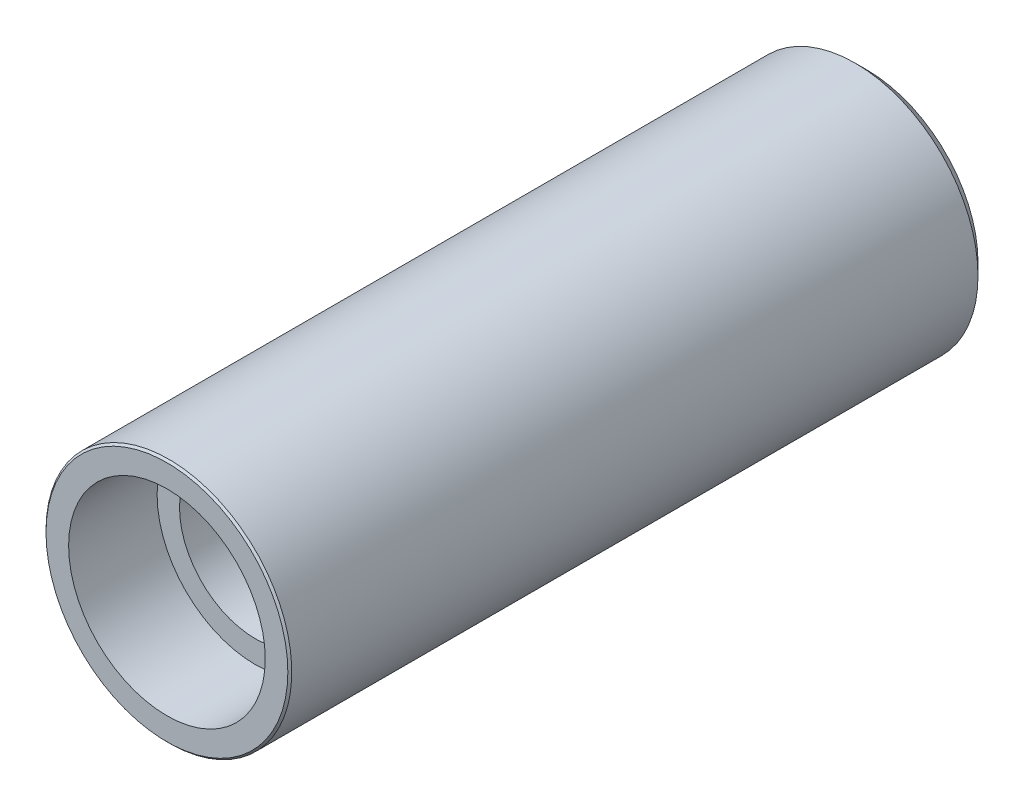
from build123d import *

# Parameters (mm, degrees)
SKETCH1_R      = 7.9375
SKETCH1_R_2    = 4.9022
EXTRUDE1_DEPTH = 45.212
SKETCH3_R      = 6.35
EXTRUDE3_DEPTH = 5.715
CHAMFER1_SIZE  = 0.762
CHAMFER2_SIZE  = 0.127


with BuildPart() as part:
    # Sketch1 → Extrude1 (new body)
    with BuildSketch(Plane.XY):
        with Locations(Location((0, 0, 0), (0, 0, 180))):
            Circle(SKETCH1_R)
        with Locations(Location((0, 0, 0), (0, 0, 180))):
            Circle(SKETCH1_R_2, mode=Mode.SUBTRACT)
    extrude(amount=EXTRUDE1_DEPTH)

    # Sketch3 → Extrude3 (cut)
    with BuildSketch(Plane.XY.offset(45.212)):
        Circle(SKETCH3_R)
    extrude(amount=-EXTRUDE3_DEPTH, mode=Mode.SUBTRACT)

    # Chamfer1
    chamfer1_edges = [part.edges().sort_by_distance(p)[0] for p in [
        (7.9375, 0, 0),
    ]]
    chamfer(chamfer1_edges, length=CHAMFER1_SIZE)

    # Chamfer2
    chamfer2_edges = [part.edges().sort_by_distance(p)[0] for p in [
        (7.9375, 0, 45.212),
    ]]
    chamfer(chamfer2_edges, length=CHAMFER2_SIZE)


solid = part.part
